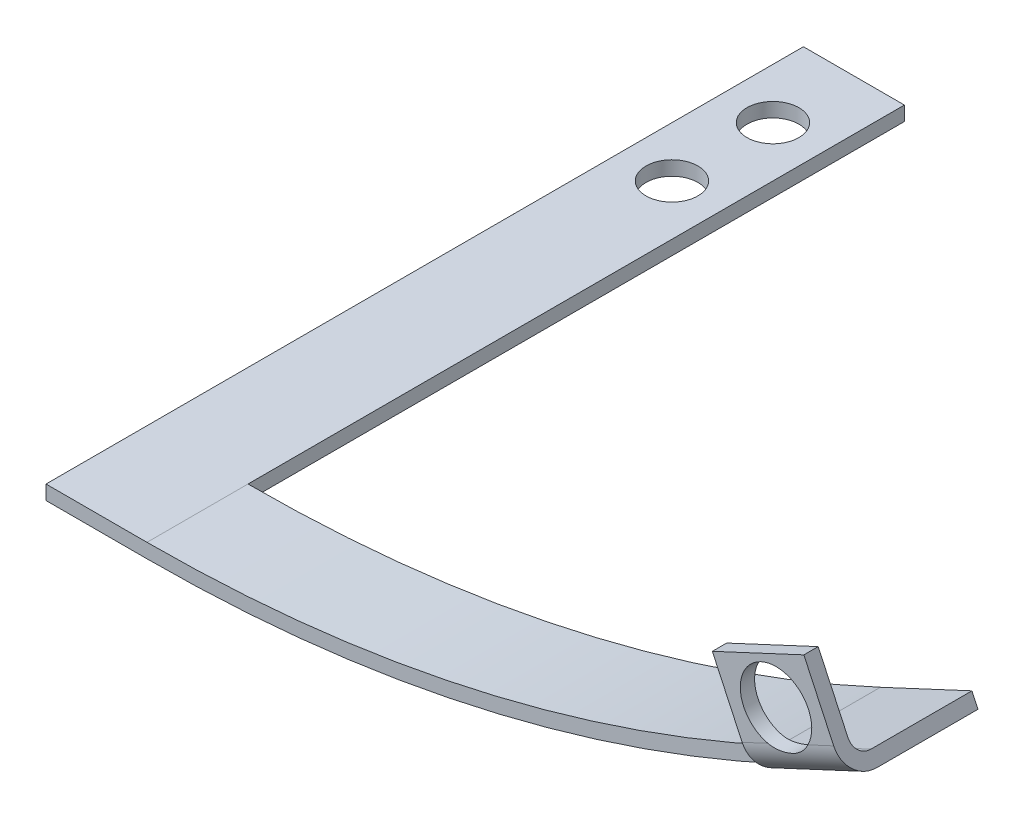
ISO-10303-21;
HEADER;
FILE_DESCRIPTION(('STEP AP214'),'2;1');
FILE_NAME('part.step','',(''),(''),'','','');
FILE_SCHEMA(('AUTOMOTIVE_DESIGN { 1 0 10303 214 1 1 1 1 }'));
ENDSEC;
DATA;
#1=APPLICATION_CONTEXT('core data for automotive mechanical design processes');
#2=APPLICATION_PROTOCOL_DEFINITION('international standard','automotive_design',2000,#1);
#3=PRODUCT_CONTEXT('',#1,'mechanical');
#4=PRODUCT('Part','Part','',(#3));
#5=PRODUCT_RELATED_PRODUCT_CATEGORY('part','',(#4));
#6=PRODUCT_DEFINITION_FORMATION('','',#4);
#7=PRODUCT_DEFINITION_CONTEXT('part definition',#1,'design');
#8=PRODUCT_DEFINITION('design','',#6,#7);
#9=PRODUCT_DEFINITION_SHAPE('','',#8);
#10=(LENGTH_UNIT() NAMED_UNIT(*) SI_UNIT(.MILLI.,.METRE.));
#11=(NAMED_UNIT(*) PLANE_ANGLE_UNIT() SI_UNIT($,.RADIAN.));
#12=(NAMED_UNIT(*) SI_UNIT($,.STERADIAN.) SOLID_ANGLE_UNIT());
#13=UNCERTAINTY_MEASURE_WITH_UNIT(LENGTH_MEASURE(1.E-05),#10,'distance_accuracy_value','');
#14=(GEOMETRIC_REPRESENTATION_CONTEXT(3) GLOBAL_UNCERTAINTY_ASSIGNED_CONTEXT((#13)) GLOBAL_UNIT_ASSIGNED_CONTEXT((#10,
#11,#12)) REPRESENTATION_CONTEXT('',''));
#15=CARTESIAN_POINT('',(0.,0.,0.));
#16=DIRECTION('',(0.,0.,1.));
#17=DIRECTION('',(1.,0.,0.));
#18=AXIS2_PLACEMENT_3D('',#15,#16,#17);
#19=CARTESIAN_POINT('',(0.,0.9,0.));
#20=DIRECTION('',(0.,0.,-1.));
#21=DIRECTION('',(-1.,0.,0.));
#22=AXIS2_PLACEMENT_3D('',#19,#20,#21);
#23=PLANE('',#22);
#24=DIRECTION('',(0.422618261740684,-0.906307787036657,0.));
#25=VECTOR('',#24,1.);
#26=CARTESIAN_POINT('',(46.4970443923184,8.90038546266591,0.));
#27=LINE('',#26,#25);
#28=CARTESIAN_POINT('',(46.1166879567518,9.7160624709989,0.));
#29=VERTEX_POINT('',#28);
#30=CARTESIAN_POINT('',(46.4970443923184,8.90038546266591,0.));
#31=VERTEX_POINT('',#30);
#32=EDGE_CURVE('E174',#29,#31,#27,.T.);
#33=ORIENTED_EDGE('',*,*,#32,.F.);
#34=CARTESIAN_POINT('',(6.34999999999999,94.996,0.));
#35=DIRECTION('',(0.,0.,-1.));
#36=DIRECTION('',(-1.,0.,0.));
#37=AXIS2_PLACEMENT_3D('',#34,#35,#36);
#38=CIRCLE('',#37,94.096);
#39=CARTESIAN_POINT('',(6.35,0.9,0.));
#40=VERTEX_POINT('',#39);
#41=EDGE_CURVE('E332',#29,#40,#38,.T.);
#42=ORIENTED_EDGE('',*,*,#41,.T.);
#43=DIRECTION('',(1.,0.,0.));
#44=VECTOR('',#43,1.);
#45=CARTESIAN_POINT('',(0.,0.9,0.));
#46=LINE('',#45,#44);
#47=CARTESIAN_POINT('',(0.,0.9,0.));
#48=VERTEX_POINT('',#47);
#49=EDGE_CURVE('E369',#48,#40,#46,.T.);
#50=ORIENTED_EDGE('',*,*,#49,.F.);
#51=DIRECTION('',(0.,-1.,0.));
#52=VECTOR('',#51,1.);
#53=CARTESIAN_POINT('',(0.,0.9,0.));
#54=LINE('',#53,#52);
#55=CARTESIAN_POINT('',(0.,0.,0.));
#56=VERTEX_POINT('',#55);
#57=EDGE_CURVE('E157',#48,#56,#54,.T.);
#58=ORIENTED_EDGE('',*,*,#57,.T.);
#59=DIRECTION('',(1.,0.,0.));
#60=VECTOR('',#59,1.);
#61=CARTESIAN_POINT('',(0.,0.,0.));
#62=LINE('',#61,#60);
#63=CARTESIAN_POINT('',(6.35,0.,0.));
#64=VERTEX_POINT('',#63);
#65=EDGE_CURVE('E393',#56,#64,#62,.T.);
#66=ORIENTED_EDGE('',*,*,#65,.T.);
#67=CARTESIAN_POINT('',(6.34999999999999,94.996,0.));
#68=DIRECTION('',(0.,0.,-1.));
#69=DIRECTION('',(-1.,0.,0.));
#70=AXIS2_PLACEMENT_3D('',#67,#68,#69);
#71=CIRCLE('',#70,94.996);
#72=EDGE_CURVE('E234',#31,#64,#71,.T.);
#73=ORIENTED_EDGE('',*,*,#72,.F.);
#74=EDGE_LOOP('',(#33,#42,#50,#58,#66,#73));
#75=FACE_BOUND('',#74,.T.);
#76=ADVANCED_FACE('F37',(#75),#23,.F.);
#77=CARTESIAN_POINT('',(6.35,0.9,0.));
#78=DIRECTION('',(-1.,0.,0.));
#79=DIRECTION('',(0.,0.,1.));
#80=AXIS2_PLACEMENT_3D('',#77,#78,#79);
#81=PLANE('',#80);
#82=DIRECTION('',(0.,1.,0.));
#83=VECTOR('',#82,1.);
#84=CARTESIAN_POINT('',(6.35,0.,-6.35));
#85=LINE('',#84,#83);
#86=CARTESIAN_POINT('',(6.35,0.,-6.35));
#87=VERTEX_POINT('',#86);
#88=CARTESIAN_POINT('',(6.35,0.9,-6.35));
#89=VERTEX_POINT('',#88);
#90=EDGE_CURVE('E219',#87,#89,#85,.T.);
#91=ORIENTED_EDGE('',*,*,#90,.F.);
#92=DIRECTION('',(0.,0.,-1.));
#93=VECTOR('',#92,1.);
#94=CARTESIAN_POINT('',(6.35,0.,0.));
#95=LINE('',#94,#93);
#96=CARTESIAN_POINT('',(6.35,0.,-47.625));
#97=VERTEX_POINT('',#96);
#98=EDGE_CURVE('E386',#87,#97,#95,.T.);
#99=ORIENTED_EDGE('',*,*,#98,.T.);
#100=DIRECTION('',(0.,-1.,0.));
#101=VECTOR('',#100,1.);
#102=CARTESIAN_POINT('',(6.35,0.9,-47.625));
#103=LINE('',#102,#101);
#104=CARTESIAN_POINT('',(6.35,0.9,-47.625));
#105=VERTEX_POINT('',#104);
#106=EDGE_CURVE('E405',#105,#97,#103,.T.);
#107=ORIENTED_EDGE('',*,*,#106,.F.);
#108=DIRECTION('',(0.,0.,-1.));
#109=VECTOR('',#108,1.);
#110=CARTESIAN_POINT('',(6.35,0.9,0.));
#111=LINE('',#110,#109);
#112=EDGE_CURVE('E372',#89,#105,#111,.T.);
#113=ORIENTED_EDGE('',*,*,#112,.F.);
#114=EDGE_LOOP('',(#91,#99,#107,#113));
#115=FACE_BOUND('',#114,.T.);
#116=ADVANCED_FACE('F321',(#115),#81,.F.);
#117=CARTESIAN_POINT('',(0.,0.9,0.));
#118=DIRECTION('',(1.,0.,0.));
#119=DIRECTION('',(0.,0.,-1.));
#120=AXIS2_PLACEMENT_3D('',#117,#118,#119);
#121=PLANE('',#120);
#122=DIRECTION('',(0.,0.,1.));
#123=VECTOR('',#122,1.);
#124=CARTESIAN_POINT('',(0.,0.,0.));
#125=LINE('',#124,#123);
#126=CARTESIAN_POINT('',(0.,0.,-47.625));
#127=VERTEX_POINT('',#126);
#128=EDGE_CURVE('E365',#127,#56,#125,.T.);
#129=ORIENTED_EDGE('',*,*,#128,.T.);
#130=ORIENTED_EDGE('',*,*,#57,.F.);
#131=DIRECTION('',(0.,0.,1.));
#132=VECTOR('',#131,1.);
#133=CARTESIAN_POINT('',(0.,0.9,0.));
#134=LINE('',#133,#132);
#135=CARTESIAN_POINT('',(0.,0.9,-47.625));
#136=VERTEX_POINT('',#135);
#137=EDGE_CURVE('E366',#136,#48,#134,.T.);
#138=ORIENTED_EDGE('',*,*,#137,.F.);
#139=DIRECTION('',(0.,-1.,0.));
#140=VECTOR('',#139,1.);
#141=CARTESIAN_POINT('',(0.,0.9,-47.625));
#142=LINE('',#141,#140);
#143=EDGE_CURVE('E403',#136,#127,#142,.T.);
#144=ORIENTED_EDGE('',*,*,#143,.T.);
#145=EDGE_LOOP('',(#129,#130,#138,#144));
#146=FACE_BOUND('',#145,.T.);
#147=ADVANCED_FACE('F39',(#146),#121,.F.);
#148=CARTESIAN_POINT('',(0.,0.9,-47.625));
#149=DIRECTION('',(0.,0.,1.));
#150=DIRECTION('',(1.,0.,0.));
#151=AXIS2_PLACEMENT_3D('',#148,#149,#150);
#152=PLANE('',#151);
#153=DIRECTION('',(-1.,0.,0.));
#154=VECTOR('',#153,1.);
#155=CARTESIAN_POINT('',(0.,0.,-47.625));
#156=LINE('',#155,#154);
#157=EDGE_CURVE('E370',#97,#127,#156,.T.);
#158=ORIENTED_EDGE('',*,*,#157,.T.);
#159=ORIENTED_EDGE('',*,*,#143,.F.);
#160=DIRECTION('',(-1.,0.,0.));
#161=VECTOR('',#160,1.);
#162=CARTESIAN_POINT('',(0.,0.9,-47.625));
#163=LINE('',#162,#161);
#164=EDGE_CURVE('E375',#105,#136,#163,.T.);
#165=ORIENTED_EDGE('',*,*,#164,.F.);
#166=ORIENTED_EDGE('',*,*,#106,.T.);
#167=EDGE_LOOP('',(#158,#159,#165,#166));
#168=FACE_BOUND('',#167,.T.);
#169=ADVANCED_FACE('F313',(#168),#152,.F.);
#170=CARTESIAN_POINT('',(0.,0.9,-47.625));
#171=DIRECTION('',(0.,-1.,0.));
#172=DIRECTION('',(0.,0.,-1.));
#173=AXIS2_PLACEMENT_3D('',#170,#171,#172);
#174=PLANE('',#173);
#175=CARTESIAN_POINT('',(3.175,0.900000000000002,-42.5340000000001));
#176=DIRECTION('',(0.,1.,0.));
#177=DIRECTION('',(0.,0.,1.));
#178=AXIS2_PLACEMENT_3D('',#175,#176,#177);
#179=CIRCLE('',#178,1.63194999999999);
#180=CARTESIAN_POINT('',(3.175,0.900000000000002,-40.9020500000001));
#181=VERTEX_POINT('',#180);
#182=EDGE_CURVE('E242',#181,#181,#179,.T.);
#183=ORIENTED_EDGE('',*,*,#182,.F.);
#184=EDGE_LOOP('',(#183));
#185=FACE_BOUND('',#184,.T.);
#186=CARTESIAN_POINT('',(3.175,0.900000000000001,-36.1840000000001));
#187=DIRECTION('',(0.,1.,0.));
#188=DIRECTION('',(0.,0.,1.));
#189=AXIS2_PLACEMENT_3D('',#186,#187,#188);
#190=CIRCLE('',#189,1.63194999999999);
#191=CARTESIAN_POINT('',(3.175,0.900000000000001,-34.5520500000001));
#192=VERTEX_POINT('',#191);
#193=EDGE_CURVE('E239',#192,#192,#190,.T.);
#194=ORIENTED_EDGE('',*,*,#193,.F.);
#195=EDGE_LOOP('',(#194));
#196=FACE_BOUND('',#195,.T.);
#197=ORIENTED_EDGE('',*,*,#137,.T.);
#198=ORIENTED_EDGE('',*,*,#49,.T.);
#199=EDGE_CURVE('E346',#40,#89,#111,.T.);
#200=ORIENTED_EDGE('',*,*,#199,.T.);
#201=ORIENTED_EDGE('',*,*,#112,.T.);
#202=ORIENTED_EDGE('',*,*,#164,.T.);
#203=EDGE_LOOP('',(#197,#198,#200,#201,#202));
#204=FACE_BOUND('',#203,.T.);
#205=ADVANCED_FACE('F310',(#185,#196,#204),#174,.F.);
#206=CARTESIAN_POINT('',(0.,0.,-47.625));
#207=DIRECTION('',(0.,-1.,0.));
#208=DIRECTION('',(0.,0.,-1.));
#209=AXIS2_PLACEMENT_3D('',#206,#207,#208);
#210=PLANE('',#209);
#211=CARTESIAN_POINT('',(3.175,0.,-42.5340000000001));
#212=DIRECTION('',(0.,-1.,0.));
#213=DIRECTION('',(0.,0.,-1.));
#214=AXIS2_PLACEMENT_3D('',#211,#212,#213);
#215=CIRCLE('',#214,1.63194999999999);
#216=CARTESIAN_POINT('',(3.175,0.,-44.1659500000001));
#217=VERTEX_POINT('',#216);
#218=EDGE_CURVE('E240',#217,#217,#215,.T.);
#219=ORIENTED_EDGE('',*,*,#218,.F.);
#220=EDGE_LOOP('',(#219));
#221=FACE_BOUND('',#220,.T.);
#222=CARTESIAN_POINT('',(3.175,0.,-36.1840000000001));
#223=DIRECTION('',(0.,-1.,0.));
#224=DIRECTION('',(0.,0.,-1.));
#225=AXIS2_PLACEMENT_3D('',#222,#223,#224);
#226=CIRCLE('',#225,1.63194999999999);
#227=CARTESIAN_POINT('',(3.175,0.,-37.8159500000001));
#228=VERTEX_POINT('',#227);
#229=EDGE_CURVE('E179',#228,#228,#226,.T.);
#230=ORIENTED_EDGE('',*,*,#229,.F.);
#231=EDGE_LOOP('',(#230));
#232=FACE_BOUND('',#231,.T.);
#233=ORIENTED_EDGE('',*,*,#128,.F.);
#234=ORIENTED_EDGE('',*,*,#157,.F.);
#235=ORIENTED_EDGE('',*,*,#98,.F.);
#236=EDGE_CURVE('E392',#64,#87,#95,.T.);
#237=ORIENTED_EDGE('',*,*,#236,.F.);
#238=ORIENTED_EDGE('',*,*,#65,.F.);
#239=EDGE_LOOP('',(#233,#234,#235,#237,#238));
#240=FACE_BOUND('',#239,.T.);
#241=ADVANCED_FACE('F308',(#221,#232,#240),#210,.T.);
#242=CARTESIAN_POINT('',(46.4970443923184,8.90038546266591,0.));
#243=DIRECTION('',(0.422618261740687,-0.906307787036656,0.));
#244=DIRECTION('',(0.906307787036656,0.422618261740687,0.));
#245=AXIS2_PLACEMENT_3D('',#242,#243,#244);
#246=PLANE('',#245);
#247=DIRECTION('',(0.,0.,-1.));
#248=VECTOR('',#247,1.);
#249=CARTESIAN_POINT('',(46.4970443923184,8.90038546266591,0.));
#250=LINE('',#249,#248);
#251=CARTESIAN_POINT('',(46.4970443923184,8.90038546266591,-6.35));
#252=VERTEX_POINT('',#251);
#253=EDGE_CURVE('E222',#31,#252,#250,.T.);
#254=ORIENTED_EDGE('',*,*,#253,.T.);
#255=DIRECTION('',(0.906307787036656,0.422618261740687,0.));
#256=VECTOR('',#255,1.);
#257=CARTESIAN_POINT('',(46.4970443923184,8.90038546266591,-6.35));
#258=LINE('',#257,#256);
#259=CARTESIAN_POINT('',(52.2520988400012,11.5840114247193,-6.35));
#260=VERTEX_POINT('',#259);
#261=EDGE_CURVE('E353',#252,#260,#258,.T.);
#262=ORIENTED_EDGE('',*,*,#261,.T.);
#263=DIRECTION('',(0.,0.,-1.));
#264=VECTOR('',#263,1.);
#265=CARTESIAN_POINT('',(52.2520988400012,11.5840114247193,0.));
#266=LINE('',#265,#264);
#267=CARTESIAN_POINT('',(52.2520988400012,11.5840114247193,0.));
#268=VERTEX_POINT('',#267);
#269=EDGE_CURVE('E351',#268,#260,#266,.T.);
#270=ORIENTED_EDGE('',*,*,#269,.F.);
#271=DIRECTION('',(0.906307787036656,0.422618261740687,0.));
#272=VECTOR('',#271,1.);
#273=CARTESIAN_POINT('',(46.4970443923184,8.90038546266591,0.));
#274=LINE('',#273,#272);
#275=EDGE_CURVE('E362',#31,#268,#274,.T.);
#276=ORIENTED_EDGE('',*,*,#275,.F.);
#277=EDGE_LOOP('',(#254,#262,#270,#276));
#278=FACE_BOUND('',#277,.T.);
#279=ADVANCED_FACE('F304',(#278),#246,.T.);
#280=CARTESIAN_POINT('',(46.1166879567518,9.7160624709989,0.));
#281=DIRECTION('',(-0.422618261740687,0.906307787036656,0.));
#282=DIRECTION('',(-0.906307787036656,-0.422618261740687,0.));
#283=AXIS2_PLACEMENT_3D('',#280,#281,#282);
#284=PLANE('',#283);
#285=DIRECTION('',(0.,0.,1.));
#286=VECTOR('',#285,1.);
#287=CARTESIAN_POINT('',(46.1166879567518,9.7160624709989,0.));
#288=LINE('',#287,#286);
#289=CARTESIAN_POINT('',(46.1166879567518,9.7160624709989,-6.35));
#290=VERTEX_POINT('',#289);
#291=EDGE_CURVE('E340',#290,#29,#288,.T.);
#292=ORIENTED_EDGE('',*,*,#291,.T.);
#293=DIRECTION('',(0.906307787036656,0.422618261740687,0.));
#294=VECTOR('',#293,1.);
#295=CARTESIAN_POINT('',(46.1166879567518,9.7160624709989,0.));
#296=LINE('',#295,#294);
#297=CARTESIAN_POINT('',(51.8717424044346,12.3996884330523,0.));
#298=VERTEX_POINT('',#297);
#299=EDGE_CURVE('E341',#29,#298,#296,.T.);
#300=ORIENTED_EDGE('',*,*,#299,.T.);
#301=DIRECTION('',(0.,0.,1.));
#302=VECTOR('',#301,1.);
#303=CARTESIAN_POINT('',(51.8717424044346,12.3996884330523,0.));
#304=LINE('',#303,#302);
#305=CARTESIAN_POINT('',(51.8717424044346,12.3996884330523,-6.35));
#306=VERTEX_POINT('',#305);
#307=EDGE_CURVE('E347',#306,#298,#304,.T.);
#308=ORIENTED_EDGE('',*,*,#307,.F.);
#309=DIRECTION('',(0.906307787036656,0.422618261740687,0.));
#310=VECTOR('',#309,1.);
#311=CARTESIAN_POINT('',(46.1166879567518,9.7160624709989,-6.35));
#312=LINE('',#311,#310);
#313=EDGE_CURVE('E343',#290,#306,#312,.T.);
#314=ORIENTED_EDGE('',*,*,#313,.F.);
#315=EDGE_LOOP('',(#292,#300,#308,#314));
#316=FACE_BOUND('',#315,.T.);
#317=ADVANCED_FACE('F300',(#316),#284,.T.);
#318=CARTESIAN_POINT('',(6.34999999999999,94.996,0.));
#319=DIRECTION('',(0.,0.,-1.));
#320=DIRECTION('',(-1.,0.,0.));
#321=AXIS2_PLACEMENT_3D('',#318,#319,#320);
#322=CYLINDRICAL_SURFACE('',#321,94.096);
#323=CARTESIAN_POINT('',(6.34999999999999,94.996,-6.35));
#324=DIRECTION('',(0.,0.,-1.));
#325=DIRECTION('',(-1.,0.,0.));
#326=AXIS2_PLACEMENT_3D('',#323,#324,#325);
#327=CIRCLE('',#326,94.096);
#328=EDGE_CURVE('E233',#290,#89,#327,.T.);
#329=ORIENTED_EDGE('',*,*,#328,.T.);
#330=ORIENTED_EDGE('',*,*,#199,.F.);
#331=ORIENTED_EDGE('',*,*,#41,.F.);
#332=ORIENTED_EDGE('',*,*,#291,.F.);
#333=EDGE_LOOP('',(#329,#330,#331,#332));
#334=FACE_BOUND('',#333,.T.);
#335=ADVANCED_FACE('F296',(#334),#322,.F.);
#336=CARTESIAN_POINT('',(46.4970443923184,8.90038546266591,-6.35));
#337=DIRECTION('',(0.,0.,1.));
#338=DIRECTION('',(1.,0.,0.));
#339=AXIS2_PLACEMENT_3D('',#336,#337,#338);
#340=PLANE('',#339);
#341=CARTESIAN_POINT('',(6.34999999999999,94.996,-6.35));
#342=DIRECTION('',(0.,0.,-1.));
#343=DIRECTION('',(-1.,0.,0.));
#344=AXIS2_PLACEMENT_3D('',#341,#342,#343);
#345=CIRCLE('',#344,94.996);
#346=EDGE_CURVE('E230',#252,#87,#345,.T.);
#347=ORIENTED_EDGE('',*,*,#346,.T.);
#348=ORIENTED_EDGE('',*,*,#90,.T.);
#349=ORIENTED_EDGE('',*,*,#328,.F.);
#350=ORIENTED_EDGE('',*,*,#313,.T.);
#351=DIRECTION('',(-0.422618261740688,0.906307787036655,0.));
#352=VECTOR('',#351,1.);
#353=CARTESIAN_POINT('',(52.2520988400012,11.5840114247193,-6.35));
#354=LINE('',#353,#352);
#355=EDGE_CURVE('E356',#260,#306,#354,.T.);
#356=ORIENTED_EDGE('',*,*,#355,.F.);
#357=ORIENTED_EDGE('',*,*,#261,.F.);
#358=EDGE_LOOP('',(#347,#348,#349,#350,#356,#357));
#359=FACE_BOUND('',#358,.T.);
#360=ADVANCED_FACE('F290',(#359),#340,.F.);
#361=CARTESIAN_POINT('',(6.34999999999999,94.996,0.));
#362=DIRECTION('',(0.,0.,-1.));
#363=DIRECTION('',(-1.,0.,0.));
#364=AXIS2_PLACEMENT_3D('',#361,#362,#363);
#365=CYLINDRICAL_SURFACE('',#364,94.996);
#366=ORIENTED_EDGE('',*,*,#253,.F.);
#367=ORIENTED_EDGE('',*,*,#72,.T.);
#368=ORIENTED_EDGE('',*,*,#236,.T.);
#369=ORIENTED_EDGE('',*,*,#346,.F.);
#370=EDGE_LOOP('',(#366,#367,#368,#369));
#371=FACE_BOUND('',#370,.T.);
#372=ADVANCED_FACE('F286',(#371),#365,.T.);
#373=CARTESIAN_POINT('',(51.8717424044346,12.3996884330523,0.));
#374=DIRECTION('',(-0.906307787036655,-0.422618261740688,0.));
#375=DIRECTION('',(0.,0.,1.));
#376=AXIS2_PLACEMENT_3D('',#373,#374,#375);
#377=PLANE('',#376);
#378=ORIENTED_EDGE('',*,*,#307,.T.);
#379=CARTESIAN_POINT('',(51.4423622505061,13.3204971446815,0.));
#380=DIRECTION('',(0.906307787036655,0.422618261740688,0.));
#381=DIRECTION('',(-0.422618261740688,0.906307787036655,0.));
#382=AXIS2_PLACEMENT_3D('',#379,#380,#381);
#383=CIRCLE('',#382,1.016);
#384=CARTESIAN_POINT('',(51.4423622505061,13.3204971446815,1.016));
#385=VERTEX_POINT('',#384);
#386=EDGE_CURVE('E186',#385,#298,#383,.T.);
#387=ORIENTED_EDGE('',*,*,#386,.F.);
#388=DIRECTION('',(-0.422618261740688,0.906307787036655,0.));
#389=VECTOR('',#388,1.);
#390=CARTESIAN_POINT('',(51.4423622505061,13.3204971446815,1.016));
#391=LINE('',#390,#389);
#392=CARTESIAN_POINT('',(49.5684728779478,17.339065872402,1.016));
#393=VERTEX_POINT('',#392);
#394=EDGE_CURVE('E216',#385,#393,#391,.T.);
#395=ORIENTED_EDGE('',*,*,#394,.T.);
#396=DIRECTION('',(0.,0.,-1.));
#397=VECTOR('',#396,1.);
#398=CARTESIAN_POINT('',(49.5684728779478,17.339065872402,1.016));
#399=LINE('',#398,#397);
#400=CARTESIAN_POINT('',(49.5684728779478,17.339065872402,1.916));
#401=VERTEX_POINT('',#400);
#402=EDGE_CURVE('E196',#401,#393,#399,.T.);
#403=ORIENTED_EDGE('',*,*,#402,.F.);
#404=DIRECTION('',(-0.422618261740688,0.906307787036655,0.));
#405=VECTOR('',#404,1.);
#406=CARTESIAN_POINT('',(51.442362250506,13.3204971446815,1.916));
#407=LINE('',#406,#405);
#408=CARTESIAN_POINT('',(51.442362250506,13.3204971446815,1.916));
#409=VERTEX_POINT('',#408);
#410=EDGE_CURVE('E208',#409,#401,#407,.T.);
#411=ORIENTED_EDGE('',*,*,#410,.F.);
#412=CARTESIAN_POINT('',(51.442362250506,13.3204971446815,0.));
#413=DIRECTION('',(0.906307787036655,0.422618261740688,0.));
#414=DIRECTION('',(-0.422618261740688,0.906307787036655,0.));
#415=AXIS2_PLACEMENT_3D('',#412,#413,#414);
#416=CIRCLE('',#415,1.916);
#417=EDGE_CURVE('E193',#409,#268,#416,.T.);
#418=ORIENTED_EDGE('',*,*,#417,.T.);
#419=ORIENTED_EDGE('',*,*,#269,.T.);
#420=ORIENTED_EDGE('',*,*,#355,.T.);
#421=EDGE_LOOP('',(#378,#387,#395,#403,#411,#418,#419,#420));
#422=FACE_BOUND('',#421,.T.);
#423=ADVANCED_FACE('F285',(#422),#377,.F.);
#424=CARTESIAN_POINT('',(45.6873078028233,10.6368711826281,1.01599999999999));
#425=DIRECTION('',(0.,0.,-1.));
#426=DIRECTION('',(-1.,0.,0.));
#427=AXIS2_PLACEMENT_3D('',#424,#425,#426);
#428=PLANE('',#427);
#429=CARTESIAN_POINT('',(47.8180685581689,13.5801300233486,1.01599999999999));
#430=DIRECTION('',(0.,0.,-1.));
#431=DIRECTION('',(-1.,0.,0.));
#432=AXIS2_PLACEMENT_3D('',#429,#430,#431);
#433=CIRCLE('',#432,2.2479);
#434=CARTESIAN_POINT('',(47.3055023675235,11.3914477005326,1.01599999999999));
#435=VERTEX_POINT('',#434);
#436=CARTESIAN_POINT('',(49.8241676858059,12.565920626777,1.01599999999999));
#437=VERTEX_POINT('',#436);
#438=EDGE_CURVE('E270',#435,#437,#433,.T.);
#439=ORIENTED_EDGE('',*,*,#438,.F.);
#440=DIRECTION('',(-0.906307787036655,-0.422618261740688,0.));
#441=VECTOR('',#440,1.);
#442=CARTESIAN_POINT('',(45.6873078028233,10.6368711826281,1.01599999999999));
#443=LINE('',#442,#441);
#444=CARTESIAN_POINT('',(45.6873078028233,10.6368711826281,1.01599999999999));
#445=VERTEX_POINT('',#444);
#446=EDGE_CURVE('E166',#435,#445,#443,.T.);
#447=ORIENTED_EDGE('',*,*,#446,.T.);
#448=DIRECTION('',(-0.422618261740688,0.906307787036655,0.));
#449=VECTOR('',#448,1.);
#450=CARTESIAN_POINT('',(45.6873078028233,10.6368711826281,1.01599999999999));
#451=LINE('',#450,#449);
#452=CARTESIAN_POINT('',(43.8134184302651,14.6554399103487,1.01599999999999));
#453=VERTEX_POINT('',#452);
#454=EDGE_CURVE('E214',#445,#453,#451,.T.);
#455=ORIENTED_EDGE('',*,*,#454,.T.);
#456=DIRECTION('',(-0.906307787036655,-0.422618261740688,0.));
#457=VECTOR('',#456,1.);
#458=CARTESIAN_POINT('',(43.8134184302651,14.6554399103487,1.01599999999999));
#459=LINE('',#458,#457);
#460=EDGE_CURVE('E205',#393,#453,#459,.T.);
#461=ORIENTED_EDGE('',*,*,#460,.F.);
#462=ORIENTED_EDGE('',*,*,#394,.F.);
#463=EDGE_CURVE('E173',#385,#437,#443,.T.);
#464=ORIENTED_EDGE('',*,*,#463,.T.);
#465=EDGE_LOOP('',(#439,#447,#455,#461,#462,#464));
#466=FACE_BOUND('',#465,.T.);
#467=ADVANCED_FACE('F281',(#466),#428,.T.);
#468=CARTESIAN_POINT('',(51.442362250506,13.3204971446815,1.916));
#469=DIRECTION('',(0.,0.,1.));
#470=DIRECTION('',(1.,0.,0.));
#471=AXIS2_PLACEMENT_3D('',#468,#469,#470);
#472=PLANE('',#471);
#473=CARTESIAN_POINT('',(47.8180685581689,13.5801300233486,1.91599999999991));
#474=DIRECTION('',(0.,0.,1.));
#475=DIRECTION('',(1.,0.,0.));
#476=AXIS2_PLACEMENT_3D('',#473,#474,#475);
#477=CIRCLE('',#476,2.2479);
#478=CARTESIAN_POINT('',(49.8241676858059,12.565920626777,1.91599999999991));
#479=VERTEX_POINT('',#478);
#480=CARTESIAN_POINT('',(47.3055023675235,11.3914477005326,1.91599999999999));
#481=VERTEX_POINT('',#480);
#482=EDGE_CURVE('E56',#479,#481,#477,.T.);
#483=ORIENTED_EDGE('',*,*,#482,.F.);
#484=DIRECTION('',(0.906307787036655,0.422618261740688,0.));
#485=VECTOR('',#484,1.);
#486=CARTESIAN_POINT('',(51.442362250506,13.3204971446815,1.916));
#487=LINE('',#486,#485);
#488=EDGE_CURVE('E177',#479,#409,#487,.T.);
#489=ORIENTED_EDGE('',*,*,#488,.T.);
#490=ORIENTED_EDGE('',*,*,#410,.T.);
#491=DIRECTION('',(0.906307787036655,0.422618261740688,0.));
#492=VECTOR('',#491,1.);
#493=CARTESIAN_POINT('',(49.5684728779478,17.339065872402,1.916));
#494=LINE('',#493,#492);
#495=CARTESIAN_POINT('',(43.8134184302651,14.6554399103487,1.91599999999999));
#496=VERTEX_POINT('',#495);
#497=EDGE_CURVE('E199',#496,#401,#494,.T.);
#498=ORIENTED_EDGE('',*,*,#497,.F.);
#499=DIRECTION('',(-0.422618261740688,0.906307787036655,0.));
#500=VECTOR('',#499,1.);
#501=CARTESIAN_POINT('',(45.6873078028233,10.6368711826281,1.91599999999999));
#502=LINE('',#501,#500);
#503=CARTESIAN_POINT('',(45.6873078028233,10.6368711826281,1.91599999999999));
#504=VERTEX_POINT('',#503);
#505=EDGE_CURVE('E211',#504,#496,#502,.T.);
#506=ORIENTED_EDGE('',*,*,#505,.F.);
#507=EDGE_CURVE('E183',#504,#481,#487,.T.);
#508=ORIENTED_EDGE('',*,*,#507,.T.);
#509=EDGE_LOOP('',(#483,#489,#490,#498,#506,#508));
#510=FACE_BOUND('',#509,.T.);
#511=ADVANCED_FACE('F277',(#510),#472,.T.);
#512=CARTESIAN_POINT('',(51.4423622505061,13.3204971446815,0.));
#513=DIRECTION('',(0.906307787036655,0.422618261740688,0.));
#514=DIRECTION('',(-0.422618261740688,0.906307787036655,0.));
#515=AXIS2_PLACEMENT_3D('',#512,#513,#514);
#516=CYLINDRICAL_SURFACE('',#515,1.916);
#517=ORIENTED_EDGE('',*,*,#488,.F.);
#518=CARTESIAN_POINT('',(49.8241676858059,12.565920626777,1.916));
#519=CARTESIAN_POINT('',(49.7959263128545,12.5100454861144,1.91599212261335));
#520=CARTESIAN_POINT('',(49.7653510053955,12.4553783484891,1.91482727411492));
#521=CARTESIAN_POINT('',(49.6997950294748,12.348845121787,1.91088079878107));
#522=CARTESIAN_POINT('',(49.6648164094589,12.2969777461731,1.9080999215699));
#523=CARTESIAN_POINT('',(49.5906592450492,12.1963353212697,1.90161459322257));
#524=CARTESIAN_POINT('',(49.5514772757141,12.1475628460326,1.89790938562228));
#525=CARTESIAN_POINT('',(49.4692111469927,12.0534692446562,1.89019589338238));
#526=CARTESIAN_POINT('',(49.4261265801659,12.0081484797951,1.88618757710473));
#527=CARTESIAN_POINT('',(49.2914516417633,11.8778484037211,1.87457552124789));
#528=CARTESIAN_POINT('',(49.1943404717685,11.7983964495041,1.86737298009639));
#529=CARTESIAN_POINT('',(48.9882717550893,11.656774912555,1.85740570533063));
#530=CARTESIAN_POINT('',(48.8793307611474,11.5945816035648,1.85463485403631));
#531=CARTESIAN_POINT('',(48.6532489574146,11.4894395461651,1.85470039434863));
#532=CARTESIAN_POINT('',(48.5361556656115,11.4463885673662,1.85750655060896));
#533=CARTESIAN_POINT('',(48.2964461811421,11.3802021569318,1.86747781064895));
#534=CARTESIAN_POINT('',(48.1738227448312,11.3570936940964,1.87464879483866));
#535=CARTESIAN_POINT('',(47.9881570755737,11.3378007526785,1.88621816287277));
#536=CARTESIAN_POINT('',(47.9257899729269,11.3339431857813,1.89022337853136));
#537=CARTESIAN_POINT('',(47.800921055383,11.3314293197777,1.89792994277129));
#538=CARTESIAN_POINT('',(47.7384192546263,11.3327724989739,1.90163132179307));
#539=CARTESIAN_POINT('',(47.6137435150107,11.3406650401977,1.90810960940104));
#540=CARTESIAN_POINT('',(47.5515693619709,11.3472104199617,1.91088722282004));
#541=CARTESIAN_POINT('',(47.427906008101,11.3654645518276,1.91482885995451));
#542=CARTESIAN_POINT('',(47.366417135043,11.3771756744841,1.91599214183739));
#543=CARTESIAN_POINT('',(47.3055023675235,11.3914477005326,1.916));
#544=B_SPLINE_CURVE_WITH_KNOTS('',3,(#518,#519,#520,#521,#522,#523,#524,#525,#526,#527,#528,
#529,#530,#531,#532,#533,#534,#535,#536,#537,#538,#539,#540,#541,#542,#543),.UNSPECIFIED.,.F.,
.F.,(4,2,2,2,2,2,2,2,2,2,2,2,4),(0.,0.187718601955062,0.375350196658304,0.563135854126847,
0.750941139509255,1.12605374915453,1.50064809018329,1.8732171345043,2.24628922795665,
2.43395708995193,2.62160612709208,2.80911165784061,2.99670332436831),.UNSPECIFIED.);
#545=EDGE_CURVE('E263',#479,#481,#544,.T.);
#546=ORIENTED_EDGE('',*,*,#545,.T.);
#547=ORIENTED_EDGE('',*,*,#507,.F.);
#548=CARTESIAN_POINT('',(45.6873078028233,10.6368711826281,0.));
#549=DIRECTION('',(0.906307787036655,0.422618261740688,0.));
#550=DIRECTION('',(-0.422618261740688,0.906307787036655,0.));
#551=AXIS2_PLACEMENT_3D('',#548,#549,#550);
#552=CIRCLE('',#551,1.91599999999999);
#553=EDGE_CURVE('E190',#504,#31,#552,.T.);
#554=ORIENTED_EDGE('',*,*,#553,.T.);
#555=ORIENTED_EDGE('',*,*,#275,.T.);
#556=ORIENTED_EDGE('',*,*,#417,.F.);
#557=EDGE_LOOP('',(#517,#546,#547,#554,#555,#556));
#558=FACE_BOUND('',#557,.T.);
#559=ADVANCED_FACE('F272',(#558),#516,.T.);
#560=CARTESIAN_POINT('',(45.6873078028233,10.6368711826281,1.91599999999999));
#561=DIRECTION('',(0.906307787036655,0.422618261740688,0.));
#562=DIRECTION('',(-0.422618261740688,0.906307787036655,0.));
#563=AXIS2_PLACEMENT_3D('',#560,#561,#562);
#564=PLANE('',#563);
#565=CARTESIAN_POINT('',(45.6873078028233,10.6368711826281,0.));
#566=DIRECTION('',(0.906307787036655,0.422618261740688,0.));
#567=DIRECTION('',(-0.422618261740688,0.906307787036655,0.));
#568=AXIS2_PLACEMENT_3D('',#565,#566,#567);
#569=CIRCLE('',#568,1.01599999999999);
#570=EDGE_CURVE('E169',#445,#29,#569,.T.);
#571=ORIENTED_EDGE('',*,*,#570,.T.);
#572=ORIENTED_EDGE('',*,*,#32,.T.);
#573=ORIENTED_EDGE('',*,*,#553,.F.);
#574=ORIENTED_EDGE('',*,*,#505,.T.);
#575=DIRECTION('',(0.,0.,1.));
#576=VECTOR('',#575,1.);
#577=CARTESIAN_POINT('',(43.8134184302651,14.6554399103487,1.91599999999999));
#578=LINE('',#577,#576);
#579=EDGE_CURVE('E202',#453,#496,#578,.T.);
#580=ORIENTED_EDGE('',*,*,#579,.F.);
#581=ORIENTED_EDGE('',*,*,#454,.F.);
#582=EDGE_LOOP('',(#571,#572,#573,#574,#580,#581));
#583=FACE_BOUND('',#582,.T.);
#584=ADVANCED_FACE('F276',(#583),#564,.F.);
#585=CARTESIAN_POINT('',(51.4423622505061,13.3204971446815,0.));
#586=DIRECTION('',(0.906307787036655,0.422618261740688,0.));
#587=DIRECTION('',(-0.422618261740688,0.906307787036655,0.));
#588=AXIS2_PLACEMENT_3D('',#585,#586,#587);
#589=CYLINDRICAL_SURFACE('',#588,1.01599999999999);
#590=ORIENTED_EDGE('',*,*,#446,.F.);
#591=CARTESIAN_POINT('',(47.3055023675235,11.3914477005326,1.01599999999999));
#592=CARTESIAN_POINT('',(47.3610962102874,11.3784261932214,1.01598526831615));
#593=CARTESIAN_POINT('',(47.4171061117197,11.3675461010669,1.01416335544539));
#594=CARTESIAN_POINT('',(47.5295753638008,11.3500943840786,1.00787059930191));
#595=CARTESIAN_POINT('',(47.5860339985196,11.3435169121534,1.00340336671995));
#596=CARTESIAN_POINT('',(47.7532783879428,11.3304250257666,0.987699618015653));
#597=CARTESIAN_POINT('',(47.8643750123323,11.3299884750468,0.974075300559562));
#598=CARTESIAN_POINT('',(48.0254864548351,11.3412405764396,0.954084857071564));
#599=CARTESIAN_POINT('',(48.0760712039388,11.3465052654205,0.947774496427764));
#600=CARTESIAN_POINT('',(48.1768272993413,11.3604612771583,0.935652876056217));
#601=CARTESIAN_POINT('',(48.2269987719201,11.3691515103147,0.929841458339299));
#602=CARTESIAN_POINT('',(48.3277227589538,11.3901516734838,0.919119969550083));
#603=CARTESIAN_POINT('',(48.3782632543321,11.4025296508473,0.914229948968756));
#604=CARTESIAN_POINT('',(48.4785117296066,11.4308076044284,0.905911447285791));
#605=CARTESIAN_POINT('',(48.5282190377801,11.446710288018,0.902484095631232));
#606=CARTESIAN_POINT('',(48.5773678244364,11.4643514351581,0.899999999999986));
#607=B_SPLINE_CURVE_WITH_KNOTS('',3,(#591,#592,#593,#594,#595,#596,#597,#598,#599,#600,#601,
#602,#603,#604,#605,#606),.UNSPECIFIED.,.F.,.F.,(4,2,2,2,2,2,2,4),(0.,0.171091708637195,
0.341950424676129,0.676233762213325,0.829899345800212,0.98351609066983,1.14016433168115,
1.29693331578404),.UNSPECIFIED.);
#608=CARTESIAN_POINT('',(48.5773678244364,11.4643514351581,0.899999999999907));
#609=VERTEX_POINT('',#608);
#610=EDGE_CURVE('E12',#435,#609,#607,.T.);
#611=ORIENTED_EDGE('',*,*,#610,.T.);
#612=CARTESIAN_POINT('',(47.4543934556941,11.2098492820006,0.990199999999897));
#613=CARTESIAN_POINT('',(47.4892629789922,11.2101185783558,0.986863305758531));
#614=CARTESIAN_POINT('',(47.5240988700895,11.2113407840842,0.98340765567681));
#615=CARTESIAN_POINT('',(47.5936421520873,11.2154788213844,0.976386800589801));
#616=CARTESIAN_POINT('',(47.6283496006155,11.2183937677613,0.972821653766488));
#617=CARTESIAN_POINT('',(47.7320983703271,11.229346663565,0.962163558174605));
#618=CARTESIAN_POINT('',(47.800911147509,11.2395955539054,0.955093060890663));
#619=CARTESIAN_POINT('',(47.9378907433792,11.2649476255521,0.941674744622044));
#620=CARTESIAN_POINT('',(48.0060550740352,11.280064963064,0.935329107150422));
#621=CARTESIAN_POINT('',(48.141470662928,11.3144728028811,0.923839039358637));
#622=CARTESIAN_POINT('',(48.2087211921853,11.3337664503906,0.918695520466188));
#623=CARTESIAN_POINT('',(48.3740903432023,11.3861788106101,0.907854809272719));
#624=CARTESIAN_POINT('',(48.4715787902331,11.4214949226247,0.903070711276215));
#625=CARTESIAN_POINT('',(48.6637585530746,11.4993238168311,0.897480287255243));
#626=CARTESIAN_POINT('',(48.7584494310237,11.5418377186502,0.896674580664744));
#627=CARTESIAN_POINT('',(48.9443087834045,11.6336270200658,0.89913217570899));
#628=CARTESIAN_POINT('',(49.0354810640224,11.6828948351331,0.902390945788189));
#629=CARTESIAN_POINT('',(49.2135708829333,11.7882560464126,0.912578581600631));
#630=CARTESIAN_POINT('',(49.3004898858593,11.8443470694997,0.919506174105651));
#631=CARTESIAN_POINT('',(49.4288308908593,11.9354868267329,0.932156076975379));
#632=CARTESIAN_POINT('',(49.4722548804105,11.9678768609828,0.936888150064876));
#633=CARTESIAN_POINT('',(49.5572949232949,12.034827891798,0.946892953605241));
#634=CARTESIAN_POINT('',(49.5989120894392,12.0693875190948,0.952165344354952));
#635=CARTESIAN_POINT('',(49.6799677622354,12.1408502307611,0.962990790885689));
#636=CARTESIAN_POINT('',(49.7194090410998,12.1777501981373,0.9685434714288));
#637=CARTESIAN_POINT('',(49.7956443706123,12.2543052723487,0.979548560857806));
#638=CARTESIAN_POINT('',(49.8324343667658,12.2939644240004,0.985000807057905));
#639=CARTESIAN_POINT('',(49.8675747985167,12.3351342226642,0.990199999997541));
#640=B_SPLINE_CURVE_WITH_KNOTS('',3,(#612,#613,#614,#615,#616,#617,#618,#619,#620,#621,#622,
#623,#624,#625,#626,#627,#628,#629,#630,#631,#632,#633,#634,#635,#636,#637,#638,#639),
.UNSPECIFIED.,.F.,.F.,(4,2,2,2,2,2,2,2,2,2,2,2,2,4),(0.,0.105053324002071,0.210051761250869,
0.419612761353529,0.629788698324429,0.840123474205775,1.1511205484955,1.46216604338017,
1.77286505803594,2.08345631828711,2.24653358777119,2.40950895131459,2.57227163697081,
2.73527816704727),.UNSPECIFIED.);
#641=CARTESIAN_POINT('',(48.9507808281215,11.6384767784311,0.899999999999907));
#642=VERTEX_POINT('',#641);
#643=EDGE_CURVE('E153',#609,#642,#640,.T.);
#644=ORIENTED_EDGE('',*,*,#643,.T.);
#645=CARTESIAN_POINT('',(48.9507808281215,11.6384767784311,0.899999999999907));
#646=CARTESIAN_POINT('',(49.0036346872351,11.6693050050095,0.902896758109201));
#647=CARTESIAN_POINT('',(49.0551454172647,11.702252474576,0.907107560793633));
#648=CARTESIAN_POINT('',(49.1551566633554,11.7721030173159,0.91744103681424));
#649=CARTESIAN_POINT('',(49.2036593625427,11.8090031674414,0.92356230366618));
#650=CARTESIAN_POINT('',(49.2963430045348,11.8856407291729,0.936853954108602));
#651=CARTESIAN_POINT('',(49.3405971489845,11.9252945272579,0.943997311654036));
#652=CARTESIAN_POINT('',(49.4258011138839,12.0079416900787,0.958586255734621));
#653=CARTESIAN_POINT('',(49.4667506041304,12.0509353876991,0.966031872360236));
#654=CARTESIAN_POINT('',(49.5678231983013,12.1658553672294,0.984458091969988));
#655=CARTESIAN_POINT('',(49.6253817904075,12.2401660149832,0.995000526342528));
#656=CARTESIAN_POINT('',(49.7050403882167,12.3575565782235,1.00682261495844));
#657=CARTESIAN_POINT('',(49.7306813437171,12.3980699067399,1.01010907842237));
#658=CARTESIAN_POINT('',(49.7793933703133,12.4807815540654,1.01469523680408));
#659=CARTESIAN_POINT('',(49.8024613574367,12.5229818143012,1.01599257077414));
#660=CARTESIAN_POINT('',(49.8241676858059,12.565920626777,1.01599999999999));
#661=B_SPLINE_CURVE_WITH_KNOTS('',3,(#645,#646,#647,#648,#649,#650,#651,#652,#653,#654,#655,
#656,#657,#658,#659,#660),.UNSPECIFIED.,.F.,.F.,(4,2,2,2,2,2,2,4),(0.,0.183659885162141,
0.367184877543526,0.546535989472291,0.725905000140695,1.00873424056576,1.15278929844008,
1.2970152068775),.UNSPECIFIED.);
#662=EDGE_CURVE('E50',#642,#437,#661,.T.);
#663=ORIENTED_EDGE('',*,*,#662,.T.);
#664=ORIENTED_EDGE('',*,*,#463,.F.);
#665=ORIENTED_EDGE('',*,*,#386,.T.);
#666=ORIENTED_EDGE('',*,*,#299,.F.);
#667=ORIENTED_EDGE('',*,*,#570,.F.);
#668=EDGE_LOOP('',(#590,#611,#644,#663,#664,#665,#666,#667));
#669=FACE_BOUND('',#668,.T.);
#670=ADVANCED_FACE('F164',(#669),#589,.F.);
#671=CARTESIAN_POINT('',(49.5684728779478,17.339065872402,1.916));
#672=DIRECTION('',(0.422618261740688,-0.906307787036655,0.));
#673=DIRECTION('',(-0.821393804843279,-0.383022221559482,-0.422618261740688));
#674=AXIS2_PLACEMENT_3D('',#671,#672,#673);
#675=PLANE('',#674);
#676=ORIENTED_EDGE('',*,*,#402,.T.);
#677=ORIENTED_EDGE('',*,*,#460,.T.);
#678=ORIENTED_EDGE('',*,*,#579,.T.);
#679=ORIENTED_EDGE('',*,*,#497,.T.);
#680=EDGE_LOOP('',(#676,#677,#678,#679));
#681=FACE_BOUND('',#680,.T.);
#682=ADVANCED_FACE('F477',(#681),#675,.F.);
#683=CARTESIAN_POINT('',(3.175,0.9,-36.1840000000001));
#684=DIRECTION('',(0.,1.,0.));
#685=DIRECTION('',(0.,0.,1.));
#686=AXIS2_PLACEMENT_3D('',#683,#684,#685);
#687=CYLINDRICAL_SURFACE('',#686,1.63194999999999);
#688=ORIENTED_EDGE('',*,*,#229,.T.);
#689=EDGE_LOOP('',(#688));
#690=FACE_BOUND('',#689,.T.);
#691=ORIENTED_EDGE('',*,*,#193,.T.);
#692=EDGE_LOOP('',(#691));
#693=FACE_BOUND('',#692,.T.);
#694=ADVANCED_FACE('F482',(#690,#693),#687,.F.);
#695=CARTESIAN_POINT('',(3.175,0.9,-42.5340000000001));
#696=DIRECTION('',(0.,1.,0.));
#697=DIRECTION('',(0.,0.,1.));
#698=AXIS2_PLACEMENT_3D('',#695,#696,#697);
#699=CYLINDRICAL_SURFACE('',#698,1.63194999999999);
#700=ORIENTED_EDGE('',*,*,#218,.T.);
#701=EDGE_LOOP('',(#700));
#702=FACE_BOUND('',#701,.T.);
#703=ORIENTED_EDGE('',*,*,#182,.T.);
#704=EDGE_LOOP('',(#703));
#705=FACE_BOUND('',#704,.T.);
#706=ADVANCED_FACE('F258',(#702,#705),#699,.F.);
#707=CARTESIAN_POINT('',(47.8180685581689,13.5801300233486,1.91599999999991));
#708=DIRECTION('',(0.,0.,1.));
#709=DIRECTION('',(1.,0.,0.));
#710=AXIS2_PLACEMENT_3D('',#707,#708,#709);
#711=CYLINDRICAL_SURFACE('',#710,2.2479);
#712=ORIENTED_EDGE('',*,*,#438,.T.);
#713=ORIENTED_EDGE('',*,*,#662,.F.);
#714=CARTESIAN_POINT('',(47.8180685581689,13.5801300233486,0.899999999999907));
#715=DIRECTION('',(0.,0.,1.));
#716=DIRECTION('',(1.,0.,0.));
#717=AXIS2_PLACEMENT_3D('',#714,#715,#716);
#718=CIRCLE('',#717,2.2479);
#719=EDGE_CURVE('E63',#609,#642,#718,.T.);
#720=ORIENTED_EDGE('',*,*,#719,.F.);
#721=ORIENTED_EDGE('',*,*,#610,.F.);
#722=EDGE_LOOP('',(#712,#713,#720,#721));
#723=FACE_BOUND('',#722,.T.);
#724=ORIENTED_EDGE('',*,*,#482,.T.);
#725=ORIENTED_EDGE('',*,*,#545,.F.);
#726=EDGE_LOOP('',(#724,#725));
#727=FACE_BOUND('',#726,.T.);
#728=ADVANCED_FACE('F160',(#723,#727),#711,.F.);
#729=CARTESIAN_POINT('',(47.8180685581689,13.5801300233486,0.899999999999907));
#730=DIRECTION('',(0.,0.,1.));
#731=DIRECTION('',(1.,0.,0.));
#732=AXIS2_PLACEMENT_3D('',#729,#730,#731);
#733=CONICAL_SURFACE('',#732,2.2479,1.02974425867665);
#734=ORIENTED_EDGE('',*,*,#719,.T.);
#735=ORIENTED_EDGE('',*,*,#643,.F.);
#736=EDGE_LOOP('',(#734,#735));
#737=FACE_BOUND('',#736,.T.);
#738=ADVANCED_FACE('F154',(#737),#733,.F.);
#739=CLOSED_SHELL('',(#76,#116,#147,#169,#205,#241,#279,#317,#335,#360,#372,#423,#467,#511,#559,
#584,#670,#682,#694,#706,#728,#738));
#740=MANIFOLD_SOLID_BREP('B2',#739);
#741=ADVANCED_BREP_SHAPE_REPRESENTATION('',(#18,#740),#14);
#742=SHAPE_DEFINITION_REPRESENTATION(#9,#741);
ENDSEC;
END-ISO-10303-21;
